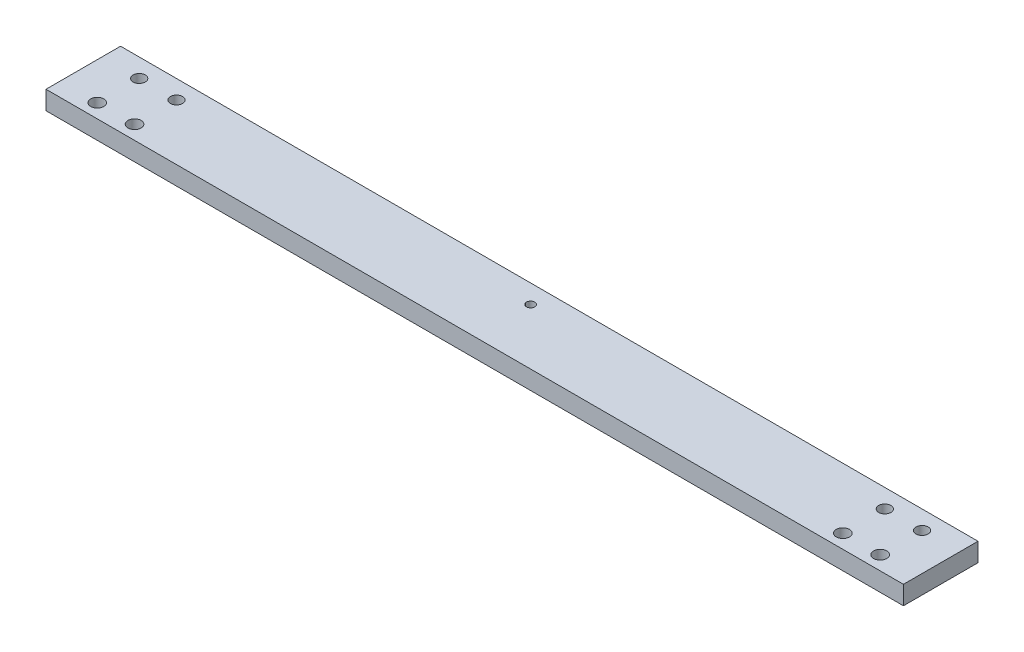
from build123d import *

# Parameters (mm, degrees)
SKETCH2_W             = 292.1
SKETCH2_H             = 25.4
BOSS_EXTRUDE1_DEPTH   = 6.35
F_8_CLEARANCE_HOLE1_D = 4.4958
F_8_32_TAPPED_HOLE1_D = 4.1656
F_4_40_TAPPED_HOLE1_D = 2.8448


with BuildPart() as part:
    # Sketch2 → Boss-Extrude1 (new body)
    with BuildSketch(Plane(origin=(0, 0, 0), x_dir=(1, 0, 0), z_dir=(0, 1, 0))):
        with Locations((0, -6.35)):
            Rectangle(SKETCH2_W, SKETCH2_H)
    extrude(amount=BOSS_EXTRUDE1_DEPTH)

    # 8 Clearance Hole1 (through all)
    with Locations(Plane(origin=(0, 6.35, 0), x_dir=(1, 0, 0), z_dir=(0, 1, 0))):
        with Locations((-133.35, -14.2875), (-120.65, -14.2875)):
            f_8_clearance_hole1 = Hole(F_8_CLEARANCE_HOLE1_D / 2)

    # 8-32 Tapped Hole1 (through all)
    with Locations(Plane(origin=(0, 6.35, 0), x_dir=(1, 0, 0), z_dir=(0, 1, 0))):
        with Locations((-133.35, 0), (-120.65, 0)):
            f_8_32_tapped_hole1 = Hole(F_8_32_TAPPED_HOLE1_D / 2)

    # Mirror1: 8 Clearance Hole1, 8-32 Tapped Hole1 across plane
    add(f_8_clearance_hole1.mirror(Plane(origin=(0, 0, 0), x_dir=(0, 0, 1), z_dir=(1, 0, 0))), mode=Mode.SUBTRACT)
    add(f_8_32_tapped_hole1.mirror(Plane(origin=(0, 0, 0), x_dir=(0, 0, 1), z_dir=(1, 0, 0))), mode=Mode.SUBTRACT)

    # 4-40 Tapped Hole1 (through all)
    with Locations(Plane(origin=(0, 6.35, 0), x_dir=(1, 0, 0), z_dir=(0, 1, 0))):
        with Locations((0, 0)):
            Hole(F_4_40_TAPPED_HOLE1_D / 2)


solid = part.part
